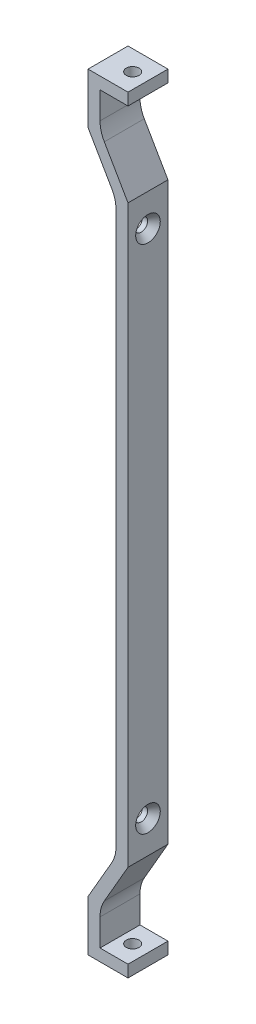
ISO-10303-21;
HEADER;
FILE_DESCRIPTION(('STEP AP214'),'2;1');
FILE_NAME('part.step','',(''),(''),'','','');
FILE_SCHEMA(('AUTOMOTIVE_DESIGN { 1 0 10303 214 1 1 1 1 }'));
ENDSEC;
DATA;
#1=APPLICATION_CONTEXT('core data for automotive mechanical design processes');
#2=APPLICATION_PROTOCOL_DEFINITION('international standard','automotive_design',2000,#1);
#3=PRODUCT_CONTEXT('',#1,'mechanical');
#4=PRODUCT('Part','Part','',(#3));
#5=PRODUCT_RELATED_PRODUCT_CATEGORY('part','',(#4));
#6=PRODUCT_DEFINITION_FORMATION('','',#4);
#7=PRODUCT_DEFINITION_CONTEXT('part definition',#1,'design');
#8=PRODUCT_DEFINITION('design','',#6,#7);
#9=PRODUCT_DEFINITION_SHAPE('','',#8);
#10=(LENGTH_UNIT() NAMED_UNIT(*) SI_UNIT(.MILLI.,.METRE.));
#11=(NAMED_UNIT(*) PLANE_ANGLE_UNIT() SI_UNIT($,.RADIAN.));
#12=(NAMED_UNIT(*) SI_UNIT($,.STERADIAN.) SOLID_ANGLE_UNIT());
#13=UNCERTAINTY_MEASURE_WITH_UNIT(LENGTH_MEASURE(1.E-05),#10,'distance_accuracy_value','');
#14=(GEOMETRIC_REPRESENTATION_CONTEXT(3) GLOBAL_UNCERTAINTY_ASSIGNED_CONTEXT((#13)) GLOBAL_UNIT_ASSIGNED_CONTEXT((#10,
#11,#12)) REPRESENTATION_CONTEXT('',''));
#15=CARTESIAN_POINT('',(0.,0.,0.));
#16=DIRECTION('',(0.,0.,1.));
#17=DIRECTION('',(1.,0.,0.));
#18=AXIS2_PLACEMENT_3D('',#15,#16,#17);
#19=CARTESIAN_POINT('',(7.9375,152.4,7.9375));
#20=DIRECTION('',(-1.,0.,0.));
#21=DIRECTION('',(0.,-1.,0.));
#22=AXIS2_PLACEMENT_3D('',#19,#20,#21);
#23=PLANE('',#22);
#24=CARTESIAN_POINT('',(7.93750000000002,-101.473,0.));
#25=DIRECTION('',(1.,0.,0.));
#26=DIRECTION('',(0.,0.,-1.));
#27=AXIS2_PLACEMENT_3D('',#24,#25,#26);
#28=CIRCLE('',#27,4.88950000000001);
#29=CARTESIAN_POINT('',(7.93750000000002,-101.473,-4.88950000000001));
#30=VERTEX_POINT('',#29);
#31=EDGE_CURVE('E528',#30,#30,#28,.T.);
#32=ORIENTED_EDGE('',*,*,#31,.F.);
#33=EDGE_LOOP('',(#32));
#34=FACE_BOUND('',#33,.T.);
#35=CARTESIAN_POINT('',(7.9375,101.473,0.));
#36=DIRECTION('',(1.,0.,0.));
#37=DIRECTION('',(0.,0.,-1.));
#38=AXIS2_PLACEMENT_3D('',#35,#36,#37);
#39=CIRCLE('',#38,4.88950000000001);
#40=CARTESIAN_POINT('',(7.9375,101.473,-4.88950000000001));
#41=VERTEX_POINT('',#40);
#42=EDGE_CURVE('E270',#41,#41,#39,.T.);
#43=ORIENTED_EDGE('',*,*,#42,.F.);
#44=EDGE_LOOP('',(#43));
#45=FACE_BOUND('',#44,.T.);
#46=DIRECTION('',(0.,0.,1.));
#47=VECTOR('',#46,1.);
#48=CARTESIAN_POINT('',(7.93750000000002,114.3,-7.9375));
#49=LINE('',#48,#47);
#50=CARTESIAN_POINT('',(7.9375,114.3,-7.9375));
#51=VERTEX_POINT('',#50);
#52=CARTESIAN_POINT('',(7.93750000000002,114.3,7.9375));
#53=VERTEX_POINT('',#52);
#54=EDGE_CURVE('E337',#51,#53,#49,.T.);
#55=ORIENTED_EDGE('',*,*,#54,.T.);
#56=DIRECTION('',(0.,1.,0.));
#57=VECTOR('',#56,1.);
#58=CARTESIAN_POINT('',(7.9375,152.4,7.9375));
#59=LINE('',#58,#57);
#60=CARTESIAN_POINT('',(7.93750000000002,-114.3,7.9375));
#61=VERTEX_POINT('',#60);
#62=EDGE_CURVE('E225',#61,#53,#59,.T.);
#63=ORIENTED_EDGE('',*,*,#62,.F.);
#64=DIRECTION('',(0.,0.,1.));
#65=VECTOR('',#64,1.);
#66=CARTESIAN_POINT('',(7.93750000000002,-114.3,-7.9375));
#67=LINE('',#66,#65);
#68=CARTESIAN_POINT('',(7.93750000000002,-114.3,-7.9375));
#69=VERTEX_POINT('',#68);
#70=EDGE_CURVE('E340',#69,#61,#67,.T.);
#71=ORIENTED_EDGE('',*,*,#70,.F.);
#72=DIRECTION('',(0.,1.,0.));
#73=VECTOR('',#72,1.);
#74=CARTESIAN_POINT('',(7.9375,152.4,-7.9375));
#75=LINE('',#74,#73);
#76=EDGE_CURVE('E355',#69,#51,#75,.T.);
#77=ORIENTED_EDGE('',*,*,#76,.T.);
#78=EDGE_LOOP('',(#55,#63,#71,#77));
#79=FACE_BOUND('',#78,.T.);
#80=ADVANCED_FACE('F48',(#34,#45,#79),#23,.F.);
#81=CARTESIAN_POINT('',(3.17500000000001,113.023891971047,-7.9375));
#82=DIRECTION('',(-1.,0.,0.));
#83=DIRECTION('',(0.,-1.,0.));
#84=AXIS2_PLACEMENT_3D('',#81,#82,#83);
#85=PLANE('',#84);
#86=CARTESIAN_POINT('',(3.17499999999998,-101.473,0.));
#87=DIRECTION('',(-1.,0.,0.));
#88=DIRECTION('',(0.,-1.,0.));
#89=AXIS2_PLACEMENT_3D('',#86,#87,#88);
#90=CIRCLE('',#89,2.55269999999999);
#91=CARTESIAN_POINT('',(3.17499999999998,-104.0257,0.));
#92=VERTEX_POINT('',#91);
#93=EDGE_CURVE('E52',#92,#92,#90,.T.);
#94=ORIENTED_EDGE('',*,*,#93,.F.);
#95=EDGE_LOOP('',(#94));
#96=FACE_BOUND('',#95,.T.);
#97=CARTESIAN_POINT('',(3.17500000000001,101.473,0.));
#98=DIRECTION('',(-1.,0.,0.));
#99=DIRECTION('',(0.,-1.,0.));
#100=AXIS2_PLACEMENT_3D('',#97,#98,#99);
#101=CIRCLE('',#100,2.55269999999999);
#102=CARTESIAN_POINT('',(3.17500000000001,98.9203,0.));
#103=VERTEX_POINT('',#102);
#104=EDGE_CURVE('E267',#103,#103,#101,.T.);
#105=ORIENTED_EDGE('',*,*,#104,.F.);
#106=EDGE_LOOP('',(#105));
#107=FACE_BOUND('',#106,.T.);
#108=DIRECTION('',(0.,-1.,0.));
#109=VECTOR('',#108,1.);
#110=CARTESIAN_POINT('',(3.17500000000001,113.023891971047,7.9375));
#111=LINE('',#110,#109);
#112=CARTESIAN_POINT('',(3.17500000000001,109.620937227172,7.9375));
#113=VERTEX_POINT('',#112);
#114=CARTESIAN_POINT('',(3.17499999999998,-109.620936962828,7.9375));
#115=VERTEX_POINT('',#114);
#116=EDGE_CURVE('E194',#113,#115,#111,.T.);
#117=ORIENTED_EDGE('',*,*,#116,.F.);
#118=DIRECTION('',(0.,0.,1.));
#119=VECTOR('',#118,1.);
#120=CARTESIAN_POINT('',(3.17500000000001,109.620937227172,-7.9375));
#121=LINE('',#120,#119);
#122=CARTESIAN_POINT('',(3.17500000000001,109.620937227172,-7.9375));
#123=VERTEX_POINT('',#122);
#124=EDGE_CURVE('E252',#113,#123,#121,.F.);
#125=ORIENTED_EDGE('',*,*,#124,.T.);
#126=DIRECTION('',(0.,-1.,0.));
#127=VECTOR('',#126,1.);
#128=CARTESIAN_POINT('',(3.17500000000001,113.023891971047,-7.9375));
#129=LINE('',#128,#127);
#130=CARTESIAN_POINT('',(3.17499999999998,-109.620936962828,-7.9375));
#131=VERTEX_POINT('',#130);
#132=EDGE_CURVE('E312',#123,#131,#129,.T.);
#133=ORIENTED_EDGE('',*,*,#132,.T.);
#134=DIRECTION('',(0.,0.,1.));
#135=VECTOR('',#134,1.);
#136=CARTESIAN_POINT('',(3.17499999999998,-109.620936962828,7.9375));
#137=LINE('',#136,#135);
#138=EDGE_CURVE('E249',#131,#115,#137,.T.);
#139=ORIENTED_EDGE('',*,*,#138,.T.);
#140=EDGE_LOOP('',(#117,#125,#133,#139));
#141=FACE_BOUND('',#140,.T.);
#142=ADVANCED_FACE('F378',(#96,#107,#141),#85,.T.);
#143=CARTESIAN_POINT('',(-7.9375,-152.4,7.9375));
#144=DIRECTION('',(0.,1.,0.));
#145=DIRECTION('',(0.,0.,1.));
#146=AXIS2_PLACEMENT_3D('',#143,#144,#145);
#147=PLANE('',#146);
#148=DIRECTION('',(1.,0.,0.));
#149=VECTOR('',#148,1.);
#150=CARTESIAN_POINT('',(-7.9375,-152.4,-7.9375));
#151=LINE('',#150,#149);
#152=CARTESIAN_POINT('',(-7.9375,-152.4,-7.9375));
#153=VERTEX_POINT('',#152);
#154=CARTESIAN_POINT('',(7.93750000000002,-152.4,-7.9375));
#155=VERTEX_POINT('',#154);
#156=EDGE_CURVE('E351',#153,#155,#151,.T.);
#157=ORIENTED_EDGE('',*,*,#156,.T.);
#158=DIRECTION('',(0.,0.,-1.));
#159=VECTOR('',#158,1.);
#160=CARTESIAN_POINT('',(7.93750000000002,-152.4,7.9375));
#161=LINE('',#160,#159);
#162=CARTESIAN_POINT('',(7.93750000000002,-152.4,7.9375));
#163=VERTEX_POINT('',#162);
#164=EDGE_CURVE('E232',#163,#155,#161,.T.);
#165=ORIENTED_EDGE('',*,*,#164,.F.);
#166=DIRECTION('',(1.,0.,0.));
#167=VECTOR('',#166,1.);
#168=CARTESIAN_POINT('',(-7.9375,-152.4,7.9375));
#169=LINE('',#168,#167);
#170=CARTESIAN_POINT('',(-7.9375,-152.4,7.9375));
#171=VERTEX_POINT('',#170);
#172=EDGE_CURVE('E213',#171,#163,#169,.T.);
#173=ORIENTED_EDGE('',*,*,#172,.F.);
#174=DIRECTION('',(0.,0.,-1.));
#175=VECTOR('',#174,1.);
#176=CARTESIAN_POINT('',(-7.9375,-152.4,7.9375));
#177=LINE('',#176,#175);
#178=EDGE_CURVE('E235',#171,#153,#177,.T.);
#179=ORIENTED_EDGE('',*,*,#178,.T.);
#180=EDGE_LOOP('',(#157,#165,#173,#179));
#181=FACE_BOUND('',#180,.T.);
#182=CARTESIAN_POINT('',(1.8415,-152.4,0.));
#183=DIRECTION('',(0.,1.,0.));
#184=DIRECTION('',(0.,0.,1.));
#185=AXIS2_PLACEMENT_3D('',#182,#183,#184);
#186=CIRCLE('',#185,2.54);
#187=CARTESIAN_POINT('',(1.8415,-152.4,-2.54));
#188=VERTEX_POINT('',#187);
#189=EDGE_CURVE('E269',#188,#188,#186,.T.);
#190=ORIENTED_EDGE('',*,*,#189,.T.);
#191=EDGE_LOOP('',(#190));
#192=FACE_BOUND('',#191,.T.);
#193=ADVANCED_FACE('F393',(#181,#192),#147,.F.);
#194=CARTESIAN_POINT('',(7.93749999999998,-147.637499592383,-7.9375));
#195=DIRECTION('',(-5.1353387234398E-08,0.999999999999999,0.));
#196=DIRECTION('',(-0.999999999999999,-5.1353387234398E-08,0.));
#197=AXIS2_PLACEMENT_3D('',#194,#195,#196);
#198=PLANE('',#197);
#199=DIRECTION('',(-0.999999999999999,-5.1353387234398E-08,0.));
#200=VECTOR('',#199,1.);
#201=CARTESIAN_POINT('',(7.93749999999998,-147.637499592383,7.9375));
#202=LINE('',#201,#200);
#203=CARTESIAN_POINT('',(7.93749999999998,-147.637499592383,7.9375));
#204=VERTEX_POINT('',#203);
#205=CARTESIAN_POINT('',(-3.17500000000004,-147.637500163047,7.9375));
#206=VERTEX_POINT('',#205);
#207=EDGE_CURVE('E295',#204,#206,#202,.T.);
#208=ORIENTED_EDGE('',*,*,#207,.F.);
#209=DIRECTION('',(0.,0.,1.));
#210=VECTOR('',#209,1.);
#211=CARTESIAN_POINT('',(7.93749999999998,-147.637499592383,-7.9375));
#212=LINE('',#211,#210);
#213=CARTESIAN_POINT('',(7.93750000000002,-147.637499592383,-7.9375));
#214=VERTEX_POINT('',#213);
#215=EDGE_CURVE('E345',#214,#204,#212,.T.);
#216=ORIENTED_EDGE('',*,*,#215,.F.);
#217=DIRECTION('',(-0.999999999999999,-5.1353387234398E-08,0.));
#218=VECTOR('',#217,1.);
#219=CARTESIAN_POINT('',(7.93749999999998,-147.637499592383,-7.9375));
#220=LINE('',#219,#218);
#221=CARTESIAN_POINT('',(-3.17500000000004,-147.637500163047,-7.9375));
#222=VERTEX_POINT('',#221);
#223=EDGE_CURVE('E317',#214,#222,#220,.T.);
#224=ORIENTED_EDGE('',*,*,#223,.T.);
#225=DIRECTION('',(0.,0.,1.));
#226=VECTOR('',#225,1.);
#227=CARTESIAN_POINT('',(-3.17500000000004,-147.637500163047,-7.9375));
#228=LINE('',#227,#226);
#229=EDGE_CURVE('E343',#222,#206,#228,.T.);
#230=ORIENTED_EDGE('',*,*,#229,.T.);
#231=EDGE_LOOP('',(#208,#216,#224,#230));
#232=FACE_BOUND('',#231,.T.);
#233=CARTESIAN_POINT('',(1.8415,-147.6375,0.));
#234=DIRECTION('',(0.,1.,0.));
#235=DIRECTION('',(0.,0.,1.));
#236=AXIS2_PLACEMENT_3D('',#233,#234,#235);
#237=CIRCLE('',#236,2.54);
#238=CARTESIAN_POINT('',(1.8415,-147.6375,-2.54));
#239=VERTEX_POINT('',#238);
#240=EDGE_CURVE('E274',#239,#239,#237,.T.);
#241=ORIENTED_EDGE('',*,*,#240,.F.);
#242=EDGE_LOOP('',(#241));
#243=FACE_BOUND('',#242,.T.);
#244=ADVANCED_FACE('F399',(#232,#243),#198,.T.);
#245=CARTESIAN_POINT('',(-7.9375,152.4,7.9375));
#246=DIRECTION('',(1.,0.,0.));
#247=DIRECTION('',(0.,0.,-1.));
#248=AXIS2_PLACEMENT_3D('',#245,#246,#247);
#249=PLANE('',#248);
#250=DIRECTION('',(0.,0.,1.));
#251=VECTOR('',#250,1.);
#252=CARTESIAN_POINT('',(-7.93750000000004,-132.271305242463,-7.9375));
#253=LINE('',#252,#251);
#254=CARTESIAN_POINT('',(-7.93750000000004,-132.271305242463,-7.9375));
#255=VERTEX_POINT('',#254);
#256=CARTESIAN_POINT('',(-7.93750000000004,-132.271305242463,7.9375));
#257=VERTEX_POINT('',#256);
#258=EDGE_CURVE('E205',#255,#257,#253,.T.);
#259=ORIENTED_EDGE('',*,*,#258,.F.);
#260=DIRECTION('',(0.,-1.,0.));
#261=VECTOR('',#260,1.);
#262=CARTESIAN_POINT('',(-7.9375,152.4,-7.9375));
#263=LINE('',#262,#261);
#264=EDGE_CURVE('E333',#255,#153,#263,.T.);
#265=ORIENTED_EDGE('',*,*,#264,.T.);
#266=ORIENTED_EDGE('',*,*,#178,.F.);
#267=DIRECTION('',(0.,-1.,0.));
#268=VECTOR('',#267,1.);
#269=CARTESIAN_POINT('',(-7.9375,152.4,7.9375));
#270=LINE('',#269,#268);
#271=EDGE_CURVE('E214',#257,#171,#270,.T.);
#272=ORIENTED_EDGE('',*,*,#271,.F.);
#273=EDGE_LOOP('',(#259,#265,#266,#272));
#274=FACE_BOUND('',#273,.T.);
#275=ADVANCED_FACE('F50',(#274),#249,.F.);
#276=DIRECTION('',(0.,0.,1.));
#277=VECTOR('',#276,1.);
#278=CARTESIAN_POINT('',(-7.9375,132.271306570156,-7.9375));
#279=LINE('',#278,#277);
#280=CARTESIAN_POINT('',(-7.9375,132.271306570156,-7.9375));
#281=VERTEX_POINT('',#280);
#282=CARTESIAN_POINT('',(-7.9375,132.271306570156,7.9375));
#283=VERTEX_POINT('',#282);
#284=EDGE_CURVE('E189',#281,#283,#279,.T.);
#285=ORIENTED_EDGE('',*,*,#284,.T.);
#286=CARTESIAN_POINT('',(-7.9375,152.4,7.9375));
#287=VERTEX_POINT('',#286);
#288=EDGE_CURVE('E202',#287,#283,#270,.T.);
#289=ORIENTED_EDGE('',*,*,#288,.F.);
#290=DIRECTION('',(0.,0.,-1.));
#291=VECTOR('',#290,1.);
#292=CARTESIAN_POINT('',(-7.9375,152.4,7.9375));
#293=LINE('',#292,#291);
#294=CARTESIAN_POINT('',(-7.9375,152.4,-7.9375));
#295=VERTEX_POINT('',#294);
#296=EDGE_CURVE('E227',#287,#295,#293,.T.);
#297=ORIENTED_EDGE('',*,*,#296,.T.);
#298=EDGE_CURVE('E204',#295,#281,#263,.T.);
#299=ORIENTED_EDGE('',*,*,#298,.T.);
#300=EDGE_LOOP('',(#285,#289,#297,#299));
#301=FACE_BOUND('',#300,.T.);
#302=ADVANCED_FACE('F200',(#301),#249,.F.);
#303=DIRECTION('',(0.,0.,1.));
#304=VECTOR('',#303,1.);
#305=CARTESIAN_POINT('',(7.93750000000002,147.6375,-7.9375));
#306=LINE('',#305,#304);
#307=CARTESIAN_POINT('',(7.93750000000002,147.6375,-7.9375));
#308=VERTEX_POINT('',#307);
#309=CARTESIAN_POINT('',(7.93750000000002,147.6375,7.9375));
#310=VERTEX_POINT('',#309);
#311=EDGE_CURVE('E331',#308,#310,#306,.T.);
#312=ORIENTED_EDGE('',*,*,#311,.F.);
#313=CARTESIAN_POINT('',(7.9375,152.4,-7.9375));
#314=VERTEX_POINT('',#313);
#315=EDGE_CURVE('E352',#308,#314,#75,.T.);
#316=ORIENTED_EDGE('',*,*,#315,.T.);
#317=DIRECTION('',(0.,0.,-1.));
#318=VECTOR('',#317,1.);
#319=CARTESIAN_POINT('',(7.9375,152.4,7.9375));
#320=LINE('',#319,#318);
#321=CARTESIAN_POINT('',(7.9375,152.4,7.9375));
#322=VERTEX_POINT('',#321);
#323=EDGE_CURVE('E229',#322,#314,#320,.T.);
#324=ORIENTED_EDGE('',*,*,#323,.F.);
#325=EDGE_CURVE('E216',#310,#322,#59,.T.);
#326=ORIENTED_EDGE('',*,*,#325,.F.);
#327=EDGE_LOOP('',(#312,#316,#324,#326));
#328=FACE_BOUND('',#327,.T.);
#329=ADVANCED_FACE('F363',(#328),#23,.F.);
#330=ORIENTED_EDGE('',*,*,#215,.T.);
#331=EDGE_CURVE('E222',#163,#204,#59,.T.);
#332=ORIENTED_EDGE('',*,*,#331,.F.);
#333=ORIENTED_EDGE('',*,*,#164,.T.);
#334=EDGE_CURVE('E353',#155,#214,#75,.T.);
#335=ORIENTED_EDGE('',*,*,#334,.T.);
#336=EDGE_LOOP('',(#330,#332,#333,#335));
#337=FACE_BOUND('',#336,.T.);
#338=ADVANCED_FACE('F396',(#337),#23,.F.);
#339=CARTESIAN_POINT('',(-7.9375,-152.4,7.9375));
#340=DIRECTION('',(0.,0.,1.));
#341=DIRECTION('',(1.,0.,0.));
#342=AXIS2_PLACEMENT_3D('',#339,#340,#341);
#343=PLANE('',#342);
#344=DIRECTION('',(-0.500000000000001,0.866025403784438,0.));
#345=VECTOR('',#344,1.);
#346=CARTESIAN_POINT('',(-3.175,133.547414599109,7.9375));
#347=LINE('',#346,#345);
#348=CARTESIAN_POINT('',(-1.47352262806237,130.600369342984,7.9375));
#349=VERTEX_POINT('',#348);
#350=EDGE_CURVE('E303',#53,#349,#347,.T.);
#351=ORIENTED_EDGE('',*,*,#350,.T.);
#352=CARTESIAN_POINT('',(9.525,136.950369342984,7.9375));
#353=DIRECTION('',(0.,0.,1.));
#354=DIRECTION('',(1.,0.,0.));
#355=AXIS2_PLACEMENT_3D('',#352,#353,#354);
#356=CIRCLE('',#355,12.7);
#357=CARTESIAN_POINT('',(-3.175,136.950369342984,7.9375));
#358=VERTEX_POINT('',#357);
#359=EDGE_CURVE('E259',#349,#358,#356,.F.);
#360=ORIENTED_EDGE('',*,*,#359,.T.);
#361=DIRECTION('',(0.,1.,0.));
#362=VECTOR('',#361,1.);
#363=CARTESIAN_POINT('',(-3.175,147.6375,7.9375));
#364=LINE('',#363,#362);
#365=CARTESIAN_POINT('',(-3.175,147.6375,7.9375));
#366=VERTEX_POINT('',#365);
#367=EDGE_CURVE('E305',#358,#366,#364,.T.);
#368=ORIENTED_EDGE('',*,*,#367,.T.);
#369=DIRECTION('',(1.,0.,0.));
#370=VECTOR('',#369,1.);
#371=CARTESIAN_POINT('',(7.93750000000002,147.6375,7.9375));
#372=LINE('',#371,#370);
#373=EDGE_CURVE('E307',#366,#310,#372,.T.);
#374=ORIENTED_EDGE('',*,*,#373,.T.);
#375=ORIENTED_EDGE('',*,*,#325,.T.);
#376=DIRECTION('',(-1.,0.,0.));
#377=VECTOR('',#376,1.);
#378=CARTESIAN_POINT('',(-7.9375,152.4,7.9375));
#379=LINE('',#378,#377);
#380=EDGE_CURVE('E211',#322,#287,#379,.T.);
#381=ORIENTED_EDGE('',*,*,#380,.T.);
#382=ORIENTED_EDGE('',*,*,#288,.T.);
#383=DIRECTION('',(0.500000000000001,-0.866025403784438,0.));
#384=VECTOR('',#383,1.);
#385=CARTESIAN_POINT('',(-7.9375,132.271306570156,7.9375));
#386=LINE('',#385,#384);
#387=CARTESIAN_POINT('',(1.47352262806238,115.970937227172,7.9375));
#388=VERTEX_POINT('',#387);
#389=EDGE_CURVE('E185',#283,#388,#386,.T.);
#390=ORIENTED_EDGE('',*,*,#389,.T.);
#391=CARTESIAN_POINT('',(-9.52499999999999,109.620937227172,7.9375));
#392=DIRECTION('',(0.,0.,1.));
#393=DIRECTION('',(1.,0.,0.));
#394=AXIS2_PLACEMENT_3D('',#391,#392,#393);
#395=CIRCLE('',#394,12.7);
#396=EDGE_CURVE('E263',#388,#113,#395,.F.);
#397=ORIENTED_EDGE('',*,*,#396,.T.);
#398=ORIENTED_EDGE('',*,*,#116,.T.);
#399=CARTESIAN_POINT('',(-9.52500000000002,-109.620936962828,7.9375));
#400=DIRECTION('',(0.,0.,1.));
#401=DIRECTION('',(1.,0.,0.));
#402=AXIS2_PLACEMENT_3D('',#399,#400,#401);
#403=CIRCLE('',#402,12.7);
#404=CARTESIAN_POINT('',(1.47352244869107,-115.970937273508,7.9375));
#405=VERTEX_POINT('',#404);
#406=EDGE_CURVE('E57',#115,#405,#403,.F.);
#407=ORIENTED_EDGE('',*,*,#406,.T.);
#408=DIRECTION('',(-0.500000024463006,-0.866025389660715,0.));
#409=VECTOR('',#408,1.);
#410=CARTESIAN_POINT('',(-7.93750000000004,-132.271305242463,7.9375));
#411=LINE('',#410,#409);
#412=EDGE_CURVE('E293',#405,#257,#411,.T.);
#413=ORIENTED_EDGE('',*,*,#412,.T.);
#414=ORIENTED_EDGE('',*,*,#271,.T.);
#415=ORIENTED_EDGE('',*,*,#172,.T.);
#416=ORIENTED_EDGE('',*,*,#331,.T.);
#417=ORIENTED_EDGE('',*,*,#207,.T.);
#418=DIRECTION('',(0.,1.,0.));
#419=VECTOR('',#418,1.);
#420=CARTESIAN_POINT('',(-3.17500000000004,-147.637500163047,7.9375));
#421=LINE('',#420,#419);
#422=CARTESIAN_POINT('',(-3.17500000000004,-136.950368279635,7.9375));
#423=VERTEX_POINT('',#422);
#424=EDGE_CURVE('E298',#206,#423,#421,.T.);
#425=ORIENTED_EDGE('',*,*,#424,.T.);
#426=CARTESIAN_POINT('',(9.52499999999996,-136.950368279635,7.9375));
#427=DIRECTION('',(0.,0.,1.));
#428=DIRECTION('',(1.,0.,0.));
#429=AXIS2_PLACEMENT_3D('',#426,#427,#428);
#430=CIRCLE('',#429,12.7);
#431=CARTESIAN_POINT('',(-1.47352244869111,-130.600367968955,7.9375));
#432=VERTEX_POINT('',#431);
#433=EDGE_CURVE('E255',#423,#432,#430,.F.);
#434=ORIENTED_EDGE('',*,*,#433,.T.);
#435=DIRECTION('',(0.500000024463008,0.866025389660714,0.));
#436=VECTOR('',#435,1.);
#437=CARTESIAN_POINT('',(-3.17500000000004,-133.54741334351,7.9375));
#438=LINE('',#437,#436);
#439=EDGE_CURVE('E301',#432,#61,#438,.T.);
#440=ORIENTED_EDGE('',*,*,#439,.T.);
#441=ORIENTED_EDGE('',*,*,#62,.T.);
#442=EDGE_LOOP('',(#351,#360,#368,#374,#375,#381,#382,#390,#397,#398,#407,#413,#414,#415,#416,
#417,#425,#434,#440,#441));
#443=FACE_BOUND('',#442,.T.);
#444=ADVANCED_FACE('F209',(#443),#343,.T.);
#445=CARTESIAN_POINT('',(-7.9375,-152.4,-7.9375));
#446=DIRECTION('',(0.,0.,1.));
#447=DIRECTION('',(1.,0.,0.));
#448=AXIS2_PLACEMENT_3D('',#445,#446,#447);
#449=PLANE('',#448);
#450=DIRECTION('',(1.,0.,0.));
#451=VECTOR('',#450,1.);
#452=CARTESIAN_POINT('',(7.93750000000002,147.6375,-7.9375));
#453=LINE('',#452,#451);
#454=CARTESIAN_POINT('',(-3.175,147.6375,-7.9375));
#455=VERTEX_POINT('',#454);
#456=EDGE_CURVE('E206',#455,#308,#453,.T.);
#457=ORIENTED_EDGE('',*,*,#456,.F.);
#458=DIRECTION('',(0.,1.,0.));
#459=VECTOR('',#458,1.);
#460=CARTESIAN_POINT('',(-3.175,147.6375,-7.9375));
#461=LINE('',#460,#459);
#462=CARTESIAN_POINT('',(-3.175,136.950369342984,-7.9375));
#463=VERTEX_POINT('',#462);
#464=EDGE_CURVE('E328',#463,#455,#461,.T.);
#465=ORIENTED_EDGE('',*,*,#464,.F.);
#466=CARTESIAN_POINT('',(9.525,136.950369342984,-7.9375));
#467=DIRECTION('',(0.,0.,1.));
#468=DIRECTION('',(1.,0.,0.));
#469=AXIS2_PLACEMENT_3D('',#466,#467,#468);
#470=CIRCLE('',#469,12.7);
#471=CARTESIAN_POINT('',(-1.47352262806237,130.600369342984,-7.9375));
#472=VERTEX_POINT('',#471);
#473=EDGE_CURVE('E261',#463,#472,#470,.T.);
#474=ORIENTED_EDGE('',*,*,#473,.T.);
#475=DIRECTION('',(-0.500000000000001,0.866025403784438,0.));
#476=VECTOR('',#475,1.);
#477=CARTESIAN_POINT('',(-3.175,133.547414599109,-7.9375));
#478=LINE('',#477,#476);
#479=EDGE_CURVE('E325',#51,#472,#478,.T.);
#480=ORIENTED_EDGE('',*,*,#479,.F.);
#481=ORIENTED_EDGE('',*,*,#76,.F.);
#482=DIRECTION('',(0.500000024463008,0.866025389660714,0.));
#483=VECTOR('',#482,1.);
#484=CARTESIAN_POINT('',(-3.17500000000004,-133.54741334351,-7.9375));
#485=LINE('',#484,#483);
#486=CARTESIAN_POINT('',(-1.47352244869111,-130.600367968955,-7.9375));
#487=VERTEX_POINT('',#486);
#488=EDGE_CURVE('E323',#487,#69,#485,.T.);
#489=ORIENTED_EDGE('',*,*,#488,.F.);
#490=CARTESIAN_POINT('',(9.52499999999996,-136.950368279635,-7.9375));
#491=DIRECTION('',(0.,0.,1.));
#492=DIRECTION('',(1.,0.,0.));
#493=AXIS2_PLACEMENT_3D('',#490,#491,#492);
#494=CIRCLE('',#493,12.7);
#495=CARTESIAN_POINT('',(-3.17500000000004,-136.950368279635,-7.9375));
#496=VERTEX_POINT('',#495);
#497=EDGE_CURVE('E257',#487,#496,#494,.T.);
#498=ORIENTED_EDGE('',*,*,#497,.T.);
#499=DIRECTION('',(0.,1.,0.));
#500=VECTOR('',#499,1.);
#501=CARTESIAN_POINT('',(-3.17500000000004,-147.637500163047,-7.9375));
#502=LINE('',#501,#500);
#503=EDGE_CURVE('E320',#222,#496,#502,.T.);
#504=ORIENTED_EDGE('',*,*,#503,.F.);
#505=ORIENTED_EDGE('',*,*,#223,.F.);
#506=ORIENTED_EDGE('',*,*,#334,.F.);
#507=ORIENTED_EDGE('',*,*,#156,.F.);
#508=ORIENTED_EDGE('',*,*,#264,.F.);
#509=DIRECTION('',(-0.500000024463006,-0.866025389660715,0.));
#510=VECTOR('',#509,1.);
#511=CARTESIAN_POINT('',(-7.93750000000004,-132.271305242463,-7.9375));
#512=LINE('',#511,#510);
#513=CARTESIAN_POINT('',(1.47352244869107,-115.970937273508,-7.9375));
#514=VERTEX_POINT('',#513);
#515=EDGE_CURVE('E315',#514,#255,#512,.T.);
#516=ORIENTED_EDGE('',*,*,#515,.F.);
#517=CARTESIAN_POINT('',(-9.52500000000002,-109.620936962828,-7.9375));
#518=DIRECTION('',(0.,0.,1.));
#519=DIRECTION('',(1.,0.,0.));
#520=AXIS2_PLACEMENT_3D('',#517,#518,#519);
#521=CIRCLE('',#520,12.7);
#522=EDGE_CURVE('E14',#514,#131,#521,.T.);
#523=ORIENTED_EDGE('',*,*,#522,.T.);
#524=ORIENTED_EDGE('',*,*,#132,.F.);
#525=CARTESIAN_POINT('',(-9.52499999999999,109.620937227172,-7.9375));
#526=DIRECTION('',(0.,0.,1.));
#527=DIRECTION('',(1.,0.,0.));
#528=AXIS2_PLACEMENT_3D('',#525,#526,#527);
#529=CIRCLE('',#528,12.7);
#530=CARTESIAN_POINT('',(1.47352262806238,115.970937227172,-7.9375));
#531=VERTEX_POINT('',#530);
#532=EDGE_CURVE('E265',#123,#531,#529,.T.);
#533=ORIENTED_EDGE('',*,*,#532,.T.);
#534=DIRECTION('',(0.500000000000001,-0.866025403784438,0.));
#535=VECTOR('',#534,1.);
#536=CARTESIAN_POINT('',(-7.9375,132.271306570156,-7.9375));
#537=LINE('',#536,#535);
#538=EDGE_CURVE('E310',#281,#531,#537,.T.);
#539=ORIENTED_EDGE('',*,*,#538,.F.);
#540=ORIENTED_EDGE('',*,*,#298,.F.);
#541=DIRECTION('',(-1.,0.,0.));
#542=VECTOR('',#541,1.);
#543=CARTESIAN_POINT('',(-7.9375,152.4,-7.9375));
#544=LINE('',#543,#542);
#545=EDGE_CURVE('E218',#314,#295,#544,.T.);
#546=ORIENTED_EDGE('',*,*,#545,.F.);
#547=ORIENTED_EDGE('',*,*,#315,.F.);
#548=EDGE_LOOP('',(#457,#465,#474,#480,#481,#489,#498,#504,#505,#506,#507,#508,#516,#523,#524,
#533,#539,#540,#546,#547));
#549=FACE_BOUND('',#548,.T.);
#550=ADVANCED_FACE('F370',(#549),#449,.F.);
#551=CARTESIAN_POINT('',(-7.9375,152.4,7.9375));
#552=DIRECTION('',(0.,-1.,0.));
#553=DIRECTION('',(0.,0.,-1.));
#554=AXIS2_PLACEMENT_3D('',#551,#552,#553);
#555=PLANE('',#554);
#556=CARTESIAN_POINT('',(1.8415,152.4,0.));
#557=DIRECTION('',(0.,1.,0.));
#558=DIRECTION('',(0.,0.,1.));
#559=AXIS2_PLACEMENT_3D('',#556,#557,#558);
#560=CIRCLE('',#559,2.54);
#561=CARTESIAN_POINT('',(1.8415,152.4,2.54));
#562=VERTEX_POINT('',#561);
#563=EDGE_CURVE('E287',#562,#562,#560,.T.);
#564=ORIENTED_EDGE('',*,*,#563,.F.);
#565=EDGE_LOOP('',(#564));
#566=FACE_BOUND('',#565,.T.);
#567=ORIENTED_EDGE('',*,*,#545,.T.);
#568=ORIENTED_EDGE('',*,*,#296,.F.);
#569=ORIENTED_EDGE('',*,*,#380,.F.);
#570=ORIENTED_EDGE('',*,*,#323,.T.);
#571=EDGE_LOOP('',(#567,#568,#569,#570));
#572=FACE_BOUND('',#571,.T.);
#573=ADVANCED_FACE('F369',(#566,#572),#555,.F.);
#574=CARTESIAN_POINT('',(-7.9375,132.271306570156,-7.9375));
#575=DIRECTION('',(-0.866025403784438,-0.500000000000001,0.));
#576=DIRECTION('',(0.500000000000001,-0.866025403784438,0.));
#577=AXIS2_PLACEMENT_3D('',#574,#575,#576);
#578=PLANE('',#577);
#579=ORIENTED_EDGE('',*,*,#538,.T.);
#580=DIRECTION('',(0.,0.,1.));
#581=VECTOR('',#580,1.);
#582=CARTESIAN_POINT('',(1.47352262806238,115.970937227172,7.9375));
#583=LINE('',#582,#581);
#584=EDGE_CURVE('E192',#531,#388,#583,.T.);
#585=ORIENTED_EDGE('',*,*,#584,.T.);
#586=ORIENTED_EDGE('',*,*,#389,.F.);
#587=ORIENTED_EDGE('',*,*,#284,.F.);
#588=EDGE_LOOP('',(#579,#585,#586,#587));
#589=FACE_BOUND('',#588,.T.);
#590=ADVANCED_FACE('F188',(#589),#578,.T.);
#591=CARTESIAN_POINT('',(-7.93750000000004,-132.271305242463,-7.9375));
#592=DIRECTION('',(-0.866025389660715,0.500000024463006,0.));
#593=DIRECTION('',(-0.500000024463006,-0.866025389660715,0.));
#594=AXIS2_PLACEMENT_3D('',#591,#592,#593);
#595=PLANE('',#594);
#596=ORIENTED_EDGE('',*,*,#412,.F.);
#597=DIRECTION('',(0.,0.,1.));
#598=VECTOR('',#597,1.);
#599=CARTESIAN_POINT('',(1.47352244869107,-115.970937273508,-7.9375));
#600=LINE('',#599,#598);
#601=EDGE_CURVE('E65',#405,#514,#600,.F.);
#602=ORIENTED_EDGE('',*,*,#601,.T.);
#603=ORIENTED_EDGE('',*,*,#515,.T.);
#604=ORIENTED_EDGE('',*,*,#258,.T.);
#605=EDGE_LOOP('',(#596,#602,#603,#604));
#606=FACE_BOUND('',#605,.T.);
#607=ADVANCED_FACE('F386',(#606),#595,.T.);
#608=CARTESIAN_POINT('',(-3.17500000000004,-147.637500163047,-7.9375));
#609=DIRECTION('',(1.,0.,0.));
#610=DIRECTION('',(0.,1.,0.));
#611=AXIS2_PLACEMENT_3D('',#608,#609,#610);
#612=PLANE('',#611);
#613=ORIENTED_EDGE('',*,*,#503,.T.);
#614=DIRECTION('',(0.,0.,1.));
#615=VECTOR('',#614,1.);
#616=CARTESIAN_POINT('',(-3.17500000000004,-136.950368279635,7.9375));
#617=LINE('',#616,#615);
#618=EDGE_CURVE('E238',#496,#423,#617,.T.);
#619=ORIENTED_EDGE('',*,*,#618,.T.);
#620=ORIENTED_EDGE('',*,*,#424,.F.);
#621=ORIENTED_EDGE('',*,*,#229,.F.);
#622=EDGE_LOOP('',(#613,#619,#620,#621));
#623=FACE_BOUND('',#622,.T.);
#624=ADVANCED_FACE('F404',(#623),#612,.T.);
#625=CARTESIAN_POINT('',(-3.17500000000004,-133.54741334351,-7.9375));
#626=DIRECTION('',(0.866025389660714,-0.500000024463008,0.));
#627=DIRECTION('',(0.500000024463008,0.866025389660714,0.));
#628=AXIS2_PLACEMENT_3D('',#625,#626,#627);
#629=PLANE('',#628);
#630=ORIENTED_EDGE('',*,*,#439,.F.);
#631=DIRECTION('',(0.,0.,1.));
#632=VECTOR('',#631,1.);
#633=CARTESIAN_POINT('',(-1.4735224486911,-130.600367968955,-7.9375));
#634=LINE('',#633,#632);
#635=EDGE_CURVE('E241',#432,#487,#634,.F.);
#636=ORIENTED_EDGE('',*,*,#635,.T.);
#637=ORIENTED_EDGE('',*,*,#488,.T.);
#638=ORIENTED_EDGE('',*,*,#70,.T.);
#639=EDGE_LOOP('',(#630,#636,#637,#638));
#640=FACE_BOUND('',#639,.T.);
#641=ADVANCED_FACE('F413',(#640),#629,.T.);
#642=CARTESIAN_POINT('',(7.93750000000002,147.6375,-7.9375));
#643=DIRECTION('',(0.,-1.,0.));
#644=DIRECTION('',(0.,0.,-1.));
#645=AXIS2_PLACEMENT_3D('',#642,#643,#644);
#646=PLANE('',#645);
#647=CARTESIAN_POINT('',(1.8415,147.6375,0.));
#648=DIRECTION('',(0.,1.,0.));
#649=DIRECTION('',(0.,0.,1.));
#650=AXIS2_PLACEMENT_3D('',#647,#648,#649);
#651=CIRCLE('',#650,2.54);
#652=CARTESIAN_POINT('',(1.8415,147.6375,2.54));
#653=VERTEX_POINT('',#652);
#654=EDGE_CURVE('E195',#653,#653,#651,.T.);
#655=ORIENTED_EDGE('',*,*,#654,.T.);
#656=EDGE_LOOP('',(#655));
#657=FACE_BOUND('',#656,.T.);
#658=ORIENTED_EDGE('',*,*,#373,.F.);
#659=DIRECTION('',(0.,0.,1.));
#660=VECTOR('',#659,1.);
#661=CARTESIAN_POINT('',(-3.175,147.6375,-7.9375));
#662=LINE('',#661,#660);
#663=EDGE_CURVE('E334',#455,#366,#662,.T.);
#664=ORIENTED_EDGE('',*,*,#663,.F.);
#665=ORIENTED_EDGE('',*,*,#456,.T.);
#666=ORIENTED_EDGE('',*,*,#311,.T.);
#667=EDGE_LOOP('',(#658,#664,#665,#666));
#668=FACE_BOUND('',#667,.T.);
#669=ADVANCED_FACE('F423',(#657,#668),#646,.T.);
#670=CARTESIAN_POINT('',(-3.175,147.6375,-7.9375));
#671=DIRECTION('',(1.,0.,0.));
#672=DIRECTION('',(0.,1.,0.));
#673=AXIS2_PLACEMENT_3D('',#670,#671,#672);
#674=PLANE('',#673);
#675=ORIENTED_EDGE('',*,*,#367,.F.);
#676=DIRECTION('',(0.,0.,1.));
#677=VECTOR('',#676,1.);
#678=CARTESIAN_POINT('',(-3.175,136.950369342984,-7.9375));
#679=LINE('',#678,#677);
#680=EDGE_CURVE('E246',#358,#463,#679,.F.);
#681=ORIENTED_EDGE('',*,*,#680,.T.);
#682=ORIENTED_EDGE('',*,*,#464,.T.);
#683=ORIENTED_EDGE('',*,*,#663,.T.);
#684=EDGE_LOOP('',(#675,#681,#682,#683));
#685=FACE_BOUND('',#684,.T.);
#686=ADVANCED_FACE('F434',(#685),#674,.T.);
#687=CARTESIAN_POINT('',(-3.175,133.547414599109,-7.9375));
#688=DIRECTION('',(0.866025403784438,0.500000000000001,0.));
#689=DIRECTION('',(-0.500000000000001,0.866025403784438,0.));
#690=AXIS2_PLACEMENT_3D('',#687,#688,#689);
#691=PLANE('',#690);
#692=ORIENTED_EDGE('',*,*,#479,.T.);
#693=DIRECTION('',(0.,0.,1.));
#694=VECTOR('',#693,1.);
#695=CARTESIAN_POINT('',(-1.47352262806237,130.600369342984,7.9375));
#696=LINE('',#695,#694);
#697=EDGE_CURVE('E243',#472,#349,#696,.T.);
#698=ORIENTED_EDGE('',*,*,#697,.T.);
#699=ORIENTED_EDGE('',*,*,#350,.F.);
#700=ORIENTED_EDGE('',*,*,#54,.F.);
#701=EDGE_LOOP('',(#692,#698,#699,#700));
#702=FACE_BOUND('',#701,.T.);
#703=ADVANCED_FACE('F433',(#702),#691,.T.);
#704=CARTESIAN_POINT('',(1.8415,147.6375,0.));
#705=DIRECTION('',(0.,1.,0.));
#706=DIRECTION('',(0.,0.,1.));
#707=AXIS2_PLACEMENT_3D('',#704,#705,#706);
#708=CYLINDRICAL_SURFACE('',#707,2.54);
#709=CARTESIAN_POINT('',(1.8415,147.6375,2.54));
#710=CARTESIAN_POINT('',(1.8415,147.687109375,2.54));
#711=CARTESIAN_POINT('',(1.8415,147.73671875,2.54));
#712=CARTESIAN_POINT('',(1.8415,147.8359375,2.54));
#713=CARTESIAN_POINT('',(1.8415,147.885546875,2.54));
#714=CARTESIAN_POINT('',(1.8415,147.984765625,2.54));
#715=CARTESIAN_POINT('',(1.8415,148.034375,2.54));
#716=CARTESIAN_POINT('',(1.8415,148.13359375,2.54));
#717=CARTESIAN_POINT('',(1.8415,148.183203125,2.54));
#718=CARTESIAN_POINT('',(1.8415,148.282421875,2.54));
#719=CARTESIAN_POINT('',(1.8415,148.33203125,2.54));
#720=CARTESIAN_POINT('',(1.8415,148.43125,2.54));
#721=CARTESIAN_POINT('',(1.8415,148.480859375,2.54));
#722=CARTESIAN_POINT('',(1.8415,148.580078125,2.54));
#723=CARTESIAN_POINT('',(1.8415,148.6296875,2.54));
#724=CARTESIAN_POINT('',(1.8415,148.72890625,2.54));
#725=CARTESIAN_POINT('',(1.8415,148.778515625,2.54));
#726=CARTESIAN_POINT('',(1.8415,148.877734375,2.54));
#727=CARTESIAN_POINT('',(1.8415,148.92734375,2.54));
#728=CARTESIAN_POINT('',(1.8415,149.0265625,2.54));
#729=CARTESIAN_POINT('',(1.8415,149.076171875,2.54));
#730=CARTESIAN_POINT('',(1.8415,149.175390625,2.54));
#731=CARTESIAN_POINT('',(1.8415,149.225,2.54));
#732=CARTESIAN_POINT('',(1.8415,149.32421875,2.54));
#733=CARTESIAN_POINT('',(1.8415,149.373828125,2.54));
#734=CARTESIAN_POINT('',(1.8415,149.473046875,2.54));
#735=CARTESIAN_POINT('',(1.8415,149.52265625,2.54));
#736=CARTESIAN_POINT('',(1.8415,149.621875,2.54));
#737=CARTESIAN_POINT('',(1.8415,149.671484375,2.54));
#738=CARTESIAN_POINT('',(1.8415,149.770703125,2.54));
#739=CARTESIAN_POINT('',(1.8415,149.8203125,2.54));
#740=CARTESIAN_POINT('',(1.8415,149.91953125,2.54));
#741=CARTESIAN_POINT('',(1.8415,149.969140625,2.54));
#742=CARTESIAN_POINT('',(1.8415,150.068359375,2.54));
#743=CARTESIAN_POINT('',(1.8415,150.11796875,2.54));
#744=CARTESIAN_POINT('',(1.8415,150.2171875,2.54));
#745=CARTESIAN_POINT('',(1.8415,150.266796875,2.54));
#746=CARTESIAN_POINT('',(1.8415,150.366015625,2.54));
#747=CARTESIAN_POINT('',(1.8415,150.415625,2.54));
#748=CARTESIAN_POINT('',(1.8415,150.51484375,2.54));
#749=CARTESIAN_POINT('',(1.8415,150.564453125,2.54));
#750=CARTESIAN_POINT('',(1.8415,150.663671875,2.54));
#751=CARTESIAN_POINT('',(1.8415,150.71328125,2.54));
#752=CARTESIAN_POINT('',(1.8415,150.8125,2.54));
#753=CARTESIAN_POINT('',(1.8415,150.862109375,2.54));
#754=CARTESIAN_POINT('',(1.8415,150.961328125,2.54));
#755=CARTESIAN_POINT('',(1.8415,151.0109375,2.54));
#756=CARTESIAN_POINT('',(1.8415,151.11015625,2.54));
#757=CARTESIAN_POINT('',(1.8415,151.159765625,2.54));
#758=CARTESIAN_POINT('',(1.8415,151.258984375,2.54));
#759=CARTESIAN_POINT('',(1.8415,151.30859375,2.54));
#760=CARTESIAN_POINT('',(1.8415,151.4078125,2.54));
#761=CARTESIAN_POINT('',(1.8415,151.457421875,2.54));
#762=CARTESIAN_POINT('',(1.8415,151.556640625,2.54));
#763=CARTESIAN_POINT('',(1.8415,151.60625,2.54));
#764=CARTESIAN_POINT('',(1.8415,151.70546875,2.54));
#765=CARTESIAN_POINT('',(1.8415,151.755078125,2.54));
#766=CARTESIAN_POINT('',(1.8415,151.854296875,2.54));
#767=CARTESIAN_POINT('',(1.8415,151.90390625,2.54));
#768=CARTESIAN_POINT('',(1.8415,152.003125,2.54));
#769=CARTESIAN_POINT('',(1.8415,152.052734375,2.54));
#770=CARTESIAN_POINT('',(1.8415,152.151953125,2.54));
#771=CARTESIAN_POINT('',(1.8415,152.2015625,2.54));
#772=CARTESIAN_POINT('',(1.8415,152.30078125,2.54));
#773=CARTESIAN_POINT('',(1.8415,152.350390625,2.54));
#774=CARTESIAN_POINT('',(1.8415,152.4,2.54));
#775=B_SPLINE_CURVE_WITH_KNOTS('',3,(#709,#710,#711,#712,#713,#714,#715,#716,#717,#718,#719,
#720,#721,#722,#723,#724,#725,#726,#727,#728,#729,#730,#731,#732,#733,#734,#735,#736,#737,#738,
#739,#740,#741,#742,#743,#744,#745,#746,#747,#748,#749,#750,#751,#752,#753,#754,#755,#756,#757,
#758,#759,#760,#761,#762,#763,#764,#765,#766,#767,#768,#769,#770,#771,#772,#773,#774),
.UNSPECIFIED.,.F.,.F.,(4,2,2,2,2,2,2,2,2,2,2,2,2,2,2,2,2,2,2,2,2,2,2,2,2,2,2,2,2,2,2,2,4),(0.,
0.148828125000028,0.297656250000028,0.446484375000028,0.595312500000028,0.744140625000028,
0.892968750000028,1.04179687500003,1.19062500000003,1.33945312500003,1.48828125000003,
1.63710937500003,1.78593750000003,1.93476562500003,2.08359375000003,2.23242187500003,
2.38125000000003,2.53007812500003,2.67890625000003,2.82773437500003,2.97656250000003,
3.12539062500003,3.27421875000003,3.42304687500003,3.57187500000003,3.72070312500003,
3.86953125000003,4.01835937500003,4.16718750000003,4.31601562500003,4.46484375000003,
4.61367187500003,4.76250000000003),.UNSPECIFIED.);
#776=EDGE_CURVE('BSEAM441',#653,#562,#775,.T.);
#777=ORIENTED_EDGE('',*,*,#654,.F.);
#778=ORIENTED_EDGE('',*,*,#563,.T.);
#779=ORIENTED_EDGE('',*,*,#776,.T.);
#780=ORIENTED_EDGE('',*,*,#776,.F.);
#781=EDGE_LOOP('',(#777,#779,#778,#780));
#782=FACE_BOUND('',#781,.T.);
#783=ADVANCED_FACE('F441',(#782),#708,.F.);
#784=CARTESIAN_POINT('',(1.8415,-147.6375,0.));
#785=DIRECTION('',(0.,-1.,0.));
#786=DIRECTION('',(0.,0.,-1.));
#787=AXIS2_PLACEMENT_3D('',#784,#785,#786);
#788=CYLINDRICAL_SURFACE('',#787,2.54);
#789=CARTESIAN_POINT('',(1.8415,-147.6375,-2.54));
#790=CARTESIAN_POINT('',(1.8415,-147.687109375,-2.54));
#791=CARTESIAN_POINT('',(1.8415,-147.73671875,-2.54));
#792=CARTESIAN_POINT('',(1.8415,-147.8359375,-2.54));
#793=CARTESIAN_POINT('',(1.8415,-147.885546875,-2.54));
#794=CARTESIAN_POINT('',(1.8415,-147.984765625,-2.54));
#795=CARTESIAN_POINT('',(1.8415,-148.034375,-2.54));
#796=CARTESIAN_POINT('',(1.8415,-148.13359375,-2.54));
#797=CARTESIAN_POINT('',(1.8415,-148.183203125,-2.54));
#798=CARTESIAN_POINT('',(1.8415,-148.282421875,-2.54));
#799=CARTESIAN_POINT('',(1.8415,-148.33203125,-2.54));
#800=CARTESIAN_POINT('',(1.8415,-148.43125,-2.54));
#801=CARTESIAN_POINT('',(1.8415,-148.480859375,-2.54));
#802=CARTESIAN_POINT('',(1.8415,-148.580078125,-2.54));
#803=CARTESIAN_POINT('',(1.8415,-148.6296875,-2.54));
#804=CARTESIAN_POINT('',(1.8415,-148.72890625,-2.54));
#805=CARTESIAN_POINT('',(1.8415,-148.778515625,-2.54));
#806=CARTESIAN_POINT('',(1.8415,-148.877734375,-2.54));
#807=CARTESIAN_POINT('',(1.8415,-148.92734375,-2.54));
#808=CARTESIAN_POINT('',(1.8415,-149.0265625,-2.54));
#809=CARTESIAN_POINT('',(1.8415,-149.076171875,-2.54));
#810=CARTESIAN_POINT('',(1.8415,-149.175390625,-2.54));
#811=CARTESIAN_POINT('',(1.8415,-149.225,-2.54));
#812=CARTESIAN_POINT('',(1.8415,-149.32421875,-2.54));
#813=CARTESIAN_POINT('',(1.8415,-149.373828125,-2.54));
#814=CARTESIAN_POINT('',(1.8415,-149.473046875,-2.54));
#815=CARTESIAN_POINT('',(1.8415,-149.52265625,-2.54));
#816=CARTESIAN_POINT('',(1.8415,-149.621875,-2.54));
#817=CARTESIAN_POINT('',(1.8415,-149.671484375,-2.54));
#818=CARTESIAN_POINT('',(1.8415,-149.770703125,-2.54));
#819=CARTESIAN_POINT('',(1.8415,-149.8203125,-2.54));
#820=CARTESIAN_POINT('',(1.8415,-149.91953125,-2.54));
#821=CARTESIAN_POINT('',(1.8415,-149.969140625,-2.54));
#822=CARTESIAN_POINT('',(1.8415,-150.068359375,-2.54));
#823=CARTESIAN_POINT('',(1.8415,-150.11796875,-2.54));
#824=CARTESIAN_POINT('',(1.8415,-150.2171875,-2.54));
#825=CARTESIAN_POINT('',(1.8415,-150.266796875,-2.54));
#826=CARTESIAN_POINT('',(1.8415,-150.366015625,-2.54));
#827=CARTESIAN_POINT('',(1.8415,-150.415625,-2.54));
#828=CARTESIAN_POINT('',(1.8415,-150.51484375,-2.54));
#829=CARTESIAN_POINT('',(1.8415,-150.564453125,-2.54));
#830=CARTESIAN_POINT('',(1.8415,-150.663671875,-2.54));
#831=CARTESIAN_POINT('',(1.8415,-150.71328125,-2.54));
#832=CARTESIAN_POINT('',(1.8415,-150.8125,-2.54));
#833=CARTESIAN_POINT('',(1.8415,-150.862109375,-2.54));
#834=CARTESIAN_POINT('',(1.8415,-150.961328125,-2.54));
#835=CARTESIAN_POINT('',(1.8415,-151.0109375,-2.54));
#836=CARTESIAN_POINT('',(1.8415,-151.11015625,-2.54));
#837=CARTESIAN_POINT('',(1.8415,-151.159765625,-2.54));
#838=CARTESIAN_POINT('',(1.8415,-151.258984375,-2.54));
#839=CARTESIAN_POINT('',(1.8415,-151.30859375,-2.54));
#840=CARTESIAN_POINT('',(1.8415,-151.4078125,-2.54));
#841=CARTESIAN_POINT('',(1.8415,-151.457421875,-2.54));
#842=CARTESIAN_POINT('',(1.8415,-151.556640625,-2.54));
#843=CARTESIAN_POINT('',(1.8415,-151.60625,-2.54));
#844=CARTESIAN_POINT('',(1.8415,-151.70546875,-2.54));
#845=CARTESIAN_POINT('',(1.8415,-151.755078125,-2.54));
#846=CARTESIAN_POINT('',(1.8415,-151.854296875,-2.54));
#847=CARTESIAN_POINT('',(1.8415,-151.90390625,-2.54));
#848=CARTESIAN_POINT('',(1.8415,-152.003125,-2.54));
#849=CARTESIAN_POINT('',(1.8415,-152.052734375,-2.54));
#850=CARTESIAN_POINT('',(1.8415,-152.151953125,-2.54));
#851=CARTESIAN_POINT('',(1.8415,-152.2015625,-2.54));
#852=CARTESIAN_POINT('',(1.8415,-152.30078125,-2.54));
#853=CARTESIAN_POINT('',(1.8415,-152.350390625,-2.54));
#854=CARTESIAN_POINT('',(1.8415,-152.4,-2.54));
#855=B_SPLINE_CURVE_WITH_KNOTS('',3,(#789,#790,#791,#792,#793,#794,#795,#796,#797,#798,#799,
#800,#801,#802,#803,#804,#805,#806,#807,#808,#809,#810,#811,#812,#813,#814,#815,#816,#817,#818,
#819,#820,#821,#822,#823,#824,#825,#826,#827,#828,#829,#830,#831,#832,#833,#834,#835,#836,#837,
#838,#839,#840,#841,#842,#843,#844,#845,#846,#847,#848,#849,#850,#851,#852,#853,#854),
.UNSPECIFIED.,.F.,.F.,(4,2,2,2,2,2,2,2,2,2,2,2,2,2,2,2,2,2,2,2,2,2,2,2,2,2,2,2,2,2,2,2,4),(0.,
0.148828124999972,0.297656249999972,0.446484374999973,0.595312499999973,0.744140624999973,
0.892968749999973,1.04179687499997,1.19062499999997,1.33945312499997,1.48828124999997,
1.63710937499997,1.78593749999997,1.93476562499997,2.08359374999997,2.23242187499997,
2.38124999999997,2.53007812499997,2.67890624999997,2.82773437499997,2.97656249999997,
3.12539062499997,3.27421874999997,3.42304687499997,3.57187499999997,3.72070312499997,
3.86953124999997,4.01835937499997,4.16718749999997,4.31601562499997,4.46484374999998,
4.61367187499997,4.76249999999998),.UNSPECIFIED.);
#856=EDGE_CURVE('BSEAM488',#239,#188,#855,.T.);
#857=ORIENTED_EDGE('',*,*,#240,.T.);
#858=ORIENTED_EDGE('',*,*,#189,.F.);
#859=ORIENTED_EDGE('',*,*,#856,.T.);
#860=ORIENTED_EDGE('',*,*,#856,.F.);
#861=EDGE_LOOP('',(#857,#859,#858,#860));
#862=FACE_BOUND('',#861,.T.);
#863=ADVANCED_FACE('F488',(#862),#788,.F.);
#864=CARTESIAN_POINT('',(9.52499999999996,-136.950368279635,-7.9375));
#865=DIRECTION('',(0.,0.,-1.));
#866=DIRECTION('',(-1.,0.,0.));
#867=AXIS2_PLACEMENT_3D('',#864,#865,#866);
#868=CYLINDRICAL_SURFACE('',#867,12.7);
#869=ORIENTED_EDGE('',*,*,#497,.F.);
#870=ORIENTED_EDGE('',*,*,#635,.F.);
#871=ORIENTED_EDGE('',*,*,#433,.F.);
#872=ORIENTED_EDGE('',*,*,#618,.F.);
#873=EDGE_LOOP('',(#869,#870,#871,#872));
#874=FACE_BOUND('',#873,.T.);
#875=ADVANCED_FACE('F408',(#874),#868,.F.);
#876=CARTESIAN_POINT('',(9.525,136.950369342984,-7.9375));
#877=DIRECTION('',(0.,0.,-1.));
#878=DIRECTION('',(-1.,0.,0.));
#879=AXIS2_PLACEMENT_3D('',#876,#877,#878);
#880=CYLINDRICAL_SURFACE('',#879,12.7);
#881=ORIENTED_EDGE('',*,*,#473,.F.);
#882=ORIENTED_EDGE('',*,*,#680,.F.);
#883=ORIENTED_EDGE('',*,*,#359,.F.);
#884=ORIENTED_EDGE('',*,*,#697,.F.);
#885=EDGE_LOOP('',(#881,#882,#883,#884));
#886=FACE_BOUND('',#885,.T.);
#887=ADVANCED_FACE('F431',(#886),#880,.F.);
#888=CARTESIAN_POINT('',(-9.52499999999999,109.620937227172,-7.9375));
#889=DIRECTION('',(0.,0.,-1.));
#890=DIRECTION('',(-1.,0.,0.));
#891=AXIS2_PLACEMENT_3D('',#888,#889,#890);
#892=CYLINDRICAL_SURFACE('',#891,12.7);
#893=ORIENTED_EDGE('',*,*,#532,.F.);
#894=ORIENTED_EDGE('',*,*,#124,.F.);
#895=ORIENTED_EDGE('',*,*,#396,.F.);
#896=ORIENTED_EDGE('',*,*,#584,.F.);
#897=EDGE_LOOP('',(#893,#894,#895,#896));
#898=FACE_BOUND('',#897,.T.);
#899=ADVANCED_FACE('F374',(#898),#892,.F.);
#900=CARTESIAN_POINT('',(-9.52500000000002,-109.620936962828,-7.9375));
#901=DIRECTION('',(0.,0.,-1.));
#902=DIRECTION('',(-1.,0.,0.));
#903=AXIS2_PLACEMENT_3D('',#900,#901,#902);
#904=CYLINDRICAL_SURFACE('',#903,12.7);
#905=ORIENTED_EDGE('',*,*,#522,.F.);
#906=ORIENTED_EDGE('',*,*,#601,.F.);
#907=ORIENTED_EDGE('',*,*,#406,.F.);
#908=ORIENTED_EDGE('',*,*,#138,.F.);
#909=EDGE_LOOP('',(#905,#906,#907,#908));
#910=FACE_BOUND('',#909,.T.);
#911=ADVANCED_FACE('F382',(#910),#904,.F.);
#912=CARTESIAN_POINT('',(7.9375,101.473,0.));
#913=DIRECTION('',(1.,0.,0.));
#914=DIRECTION('',(0.,0.,-1.));
#915=AXIS2_PLACEMENT_3D('',#912,#913,#914);
#916=CONICAL_SURFACE('',#915,4.88950000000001,0.71558499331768);
#917=CARTESIAN_POINT('',(5.24931910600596,101.473,0.));
#918=DIRECTION('',(1.,0.,0.));
#919=DIRECTION('',(0.,0.,-1.));
#920=AXIS2_PLACEMENT_3D('',#917,#918,#919);
#921=CIRCLE('',#920,2.55269999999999);
#922=CARTESIAN_POINT('',(5.24931910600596,101.473,-2.55269999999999));
#923=VERTEX_POINT('',#922);
#924=EDGE_CURVE('E277',#923,#923,#921,.T.);
#925=ORIENTED_EDGE('',*,*,#924,.F.);
#926=EDGE_LOOP('',(#925));
#927=FACE_BOUND('',#926,.T.);
#928=ORIENTED_EDGE('',*,*,#42,.T.);
#929=EDGE_LOOP('',(#928));
#930=FACE_BOUND('',#929,.T.);
#931=ADVANCED_FACE('F506',(#927,#930),#916,.F.);
#932=CARTESIAN_POINT('',(7.9375,101.473,0.));
#933=DIRECTION('',(1.,0.,0.));
#934=DIRECTION('',(0.,0.,-1.));
#935=AXIS2_PLACEMENT_3D('',#932,#933,#934);
#936=CYLINDRICAL_SURFACE('',#935,2.55269999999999);
#937=ORIENTED_EDGE('',*,*,#104,.T.);
#938=EDGE_LOOP('',(#937));
#939=FACE_BOUND('',#938,.T.);
#940=ORIENTED_EDGE('',*,*,#924,.T.);
#941=EDGE_LOOP('',(#940));
#942=FACE_BOUND('',#941,.T.);
#943=ADVANCED_FACE('F509',(#939,#942),#936,.F.);
#944=CARTESIAN_POINT('',(7.93750000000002,-101.473,0.));
#945=DIRECTION('',(1.,0.,0.));
#946=DIRECTION('',(0.,0.,-1.));
#947=AXIS2_PLACEMENT_3D('',#944,#945,#946);
#948=CONICAL_SURFACE('',#947,4.88950000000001,0.71558499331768);
#949=CARTESIAN_POINT('',(5.24931910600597,-101.473,0.));
#950=DIRECTION('',(1.,0.,0.));
#951=DIRECTION('',(0.,0.,-1.));
#952=AXIS2_PLACEMENT_3D('',#949,#950,#951);
#953=CIRCLE('',#952,2.55269999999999);
#954=CARTESIAN_POINT('',(5.24931910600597,-101.473,-2.55269999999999));
#955=VERTEX_POINT('',#954);
#956=EDGE_CURVE('E527',#955,#955,#953,.T.);
#957=ORIENTED_EDGE('',*,*,#956,.F.);
#958=EDGE_LOOP('',(#957));
#959=FACE_BOUND('',#958,.T.);
#960=ORIENTED_EDGE('',*,*,#31,.T.);
#961=EDGE_LOOP('',(#960));
#962=FACE_BOUND('',#961,.T.);
#963=ADVANCED_FACE('F513',(#959,#962),#948,.F.);
#964=CARTESIAN_POINT('',(7.93750000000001,-101.473,0.));
#965=DIRECTION('',(1.,0.,0.));
#966=DIRECTION('',(0.,0.,-1.));
#967=AXIS2_PLACEMENT_3D('',#964,#965,#966);
#968=CYLINDRICAL_SURFACE('',#967,2.55269999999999);
#969=ORIENTED_EDGE('',*,*,#93,.T.);
#970=EDGE_LOOP('',(#969));
#971=FACE_BOUND('',#970,.T.);
#972=ORIENTED_EDGE('',*,*,#956,.T.);
#973=EDGE_LOOP('',(#972));
#974=FACE_BOUND('',#973,.T.);
#975=ADVANCED_FACE('F516',(#971,#974),#968,.F.);
#976=CLOSED_SHELL('',(#80,#142,#193,#244,#275,#302,#329,#338,#444,#550,#573,#590,#607,#624,#641,
#669,#686,#703,#783,#863,#875,#887,#899,#911,#931,#943,#963,#975));
#977=MANIFOLD_SOLID_BREP('B2',#976);
#978=ADVANCED_BREP_SHAPE_REPRESENTATION('',(#18,#977),#14);
#979=SHAPE_DEFINITION_REPRESENTATION(#9,#978);
ENDSEC;
END-ISO-10303-21;
